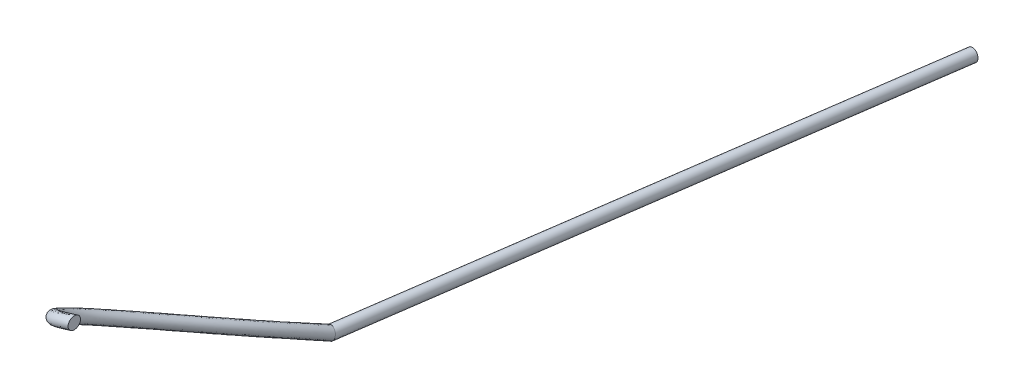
ISO-10303-21;
HEADER;
FILE_DESCRIPTION(('STEP AP214'),'2;1');
FILE_NAME('part.step','',(''),(''),'','','');
FILE_SCHEMA(('AUTOMOTIVE_DESIGN { 1 0 10303 214 1 1 1 1 }'));
ENDSEC;
DATA;
#1=APPLICATION_CONTEXT('core data for automotive mechanical design processes');
#2=APPLICATION_PROTOCOL_DEFINITION('international standard','automotive_design',2000,#1);
#3=PRODUCT_CONTEXT('',#1,'mechanical');
#4=PRODUCT('Part','Part','',(#3));
#5=PRODUCT_RELATED_PRODUCT_CATEGORY('part','',(#4));
#6=PRODUCT_DEFINITION_FORMATION('','',#4);
#7=PRODUCT_DEFINITION_CONTEXT('part definition',#1,'design');
#8=PRODUCT_DEFINITION('design','',#6,#7);
#9=PRODUCT_DEFINITION_SHAPE('','',#8);
#10=(LENGTH_UNIT() NAMED_UNIT(*) SI_UNIT(.MILLI.,.METRE.));
#11=(NAMED_UNIT(*) PLANE_ANGLE_UNIT() SI_UNIT($,.RADIAN.));
#12=(NAMED_UNIT(*) SI_UNIT($,.STERADIAN.) SOLID_ANGLE_UNIT());
#13=UNCERTAINTY_MEASURE_WITH_UNIT(LENGTH_MEASURE(1.E-05),#10,'distance_accuracy_value','');
#14=(GEOMETRIC_REPRESENTATION_CONTEXT(3) GLOBAL_UNCERTAINTY_ASSIGNED_CONTEXT((#13)) GLOBAL_UNIT_ASSIGNED_CONTEXT((#10,
#11,#12)) REPRESENTATION_CONTEXT('',''));
#15=CARTESIAN_POINT('',(0.,0.,0.));
#16=DIRECTION('',(0.,0.,1.));
#17=DIRECTION('',(1.,0.,0.));
#18=AXIS2_PLACEMENT_3D('',#15,#16,#17);
#19=CARTESIAN_POINT('',(-17.0427389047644,-267.676806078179,106.580411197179));
#20=CARTESIAN_POINT('',(-17.7285508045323,-267.849592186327,106.643436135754));
#21=CARTESIAN_POINT('',(-19.0533972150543,-268.18337912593,106.765187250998));
#22=CARTESIAN_POINT('',(-21.1201998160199,-268.789453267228,106.784475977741));
#23=CARTESIAN_POINT('',(-23.025936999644,-269.516233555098,106.4665127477));
#24=CARTESIAN_POINT('',(-24.6776012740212,-270.342091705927,105.799146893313));
#25=CARTESIAN_POINT('',(-26.0114073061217,-271.245941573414,104.786544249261));
#26=CARTESIAN_POINT('',(-26.979310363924,-272.179148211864,103.49732285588));
#27=CARTESIAN_POINT('',(-27.5980570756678,-273.102416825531,102.020016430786));
#28=CARTESIAN_POINT('',(-27.9234426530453,-274.004580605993,100.410180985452));
#29=CARTESIAN_POINT('',(-28.0102352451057,-274.892498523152,98.686724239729));
#30=CARTESIAN_POINT('',(-27.7342864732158,-276.927503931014,94.4539287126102));
#31=CARTESIAN_POINT('',(-25.6707994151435,-279.811967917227,87.4583805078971));
#32=CARTESIAN_POINT('',(-21.6918461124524,-283.442468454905,77.8296465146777));
#33=CARTESIAN_POINT('',(-17.0369705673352,-287.027333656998,67.8924653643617));
#34=CARTESIAN_POINT('',(-12.0725304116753,-290.908444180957,57.1699750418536));
#35=CARTESIAN_POINT('',(-7.921328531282,-295.151095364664,46.1972954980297));
#36=CARTESIAN_POINT('',(-5.6273239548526,-298.393398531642,38.4021256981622));
#37=CARTESIAN_POINT('',(-4.57502816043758,-299.880693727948,34.8263593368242));
#38=CARTESIAN_POINT('',(-17.0078380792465,-263.676958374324,106.580938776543));
#39=CARTESIAN_POINT('',(-17.7024242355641,-263.849380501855,106.649917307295));
#40=CARTESIAN_POINT('',(-19.0442206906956,-264.182464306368,106.783169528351));
#41=CARTESIAN_POINT('',(-21.3573952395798,-264.794373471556,106.937529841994));
#42=CARTESIAN_POINT('',(-23.6304688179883,-265.564635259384,106.751416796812));
#43=CARTESIAN_POINT('',(-25.7356227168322,-266.49036843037,106.154469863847));
#44=CARTESIAN_POINT('',(-27.5518285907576,-267.556753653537,105.104231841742));
#45=CARTESIAN_POINT('',(-28.9369933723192,-268.68585937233,103.671877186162));
#46=CARTESIAN_POINT('',(-29.8600439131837,-269.79692175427,102.000364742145));
#47=CARTESIAN_POINT('',(-30.38719220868,-270.856548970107,100.195886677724));
#48=CARTESIAN_POINT('',(-30.603969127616,-271.86934892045,98.3001755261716));
#49=CARTESIAN_POINT('',(-30.5165688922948,-274.126265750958,93.7359912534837));
#50=CARTESIAN_POINT('',(-28.4828849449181,-277.130658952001,86.5187785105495));
#51=CARTESIAN_POINT('',(-24.531103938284,-280.833452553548,76.7594514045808));
#52=CARTESIAN_POINT('',(-19.8794876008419,-284.44036464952,66.7874930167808));
#53=CARTESIAN_POINT('',(-14.8984500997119,-288.279185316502,56.1116912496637));
#54=CARTESIAN_POINT('',(-10.7362991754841,-292.417360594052,45.4170236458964));
#55=CARTESIAN_POINT('',(-8.38836587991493,-295.67215593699,37.3986216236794));
#56=CARTESIAN_POINT('',(-7.31133213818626,-297.16518148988,33.720455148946));
#57=CARTESIAN_POINT('',(-16.9473788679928,-263.676958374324,102.58139571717));
#58=CARTESIAN_POINT('',(-17.6237721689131,-263.844280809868,102.64973413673));
#59=CARTESIAN_POINT('',(-18.9304237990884,-264.16751306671,102.781749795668));
#60=CARTESIAN_POINT('',(-20.7693724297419,-264.621906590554,102.968575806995));
#61=CARTESIAN_POINT('',(-22.4146943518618,-265.126288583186,102.940140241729));
#62=CARTESIAN_POINT('',(-23.8502061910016,-265.682571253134,102.682981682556));
#63=CARTESIAN_POINT('',(-25.0824443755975,-266.305733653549,102.171047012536));
#64=CARTESIAN_POINT('',(-26.0886178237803,-267.002121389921,101.378076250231));
#65=CARTESIAN_POINT('',(-26.8377199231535,-267.757527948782,100.314004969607));
#66=CARTESIAN_POINT('',(-27.3246696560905,-268.551948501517,99.0158013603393));
#67=CARTESIAN_POINT('',(-27.5689922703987,-269.372981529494,97.5198903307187));
#68=CARTESIAN_POINT('',(-27.6144831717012,-271.315359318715,93.6637308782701));
#69=CARTESIAN_POINT('',(-25.7955596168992,-274.19437201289,86.8249096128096));
#70=CARTESIAN_POINT('',(-21.953329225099,-277.815529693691,77.2957523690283));
#71=CARTESIAN_POINT('',(-17.3511590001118,-281.401491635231,67.3912863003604));
#72=CARTESIAN_POINT('',(-12.2849548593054,-285.285639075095,56.5880529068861));
#73=CARTESIAN_POINT('',(-7.98835948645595,-289.514969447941,45.6693276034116));
#74=CARTESIAN_POINT('',(-5.58629998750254,-292.816096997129,37.4215273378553));
#75=CARTESIAN_POINT('',(-4.48443770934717,-294.330375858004,33.638132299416));
#76=CARTESIAN_POINT('',(-16.9822796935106,-267.676806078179,102.580868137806));
#77=CARTESIAN_POINT('',(-17.6498987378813,-267.84449249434,102.643252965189));
#78=CARTESIAN_POINT('',(-18.9396003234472,-268.168427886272,102.763767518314));
#79=CARTESIAN_POINT('',(-20.532177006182,-268.616986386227,102.815521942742));
#80=CARTESIAN_POINT('',(-21.8101625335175,-269.077886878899,102.655236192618));
#81=CARTESIAN_POINT('',(-22.7921847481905,-269.53429452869,102.327658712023));
#82=CARTESIAN_POINT('',(-23.5420230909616,-269.994921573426,101.853359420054));
#83=CARTESIAN_POINT('',(-24.1309348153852,-270.495410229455,101.20352191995));
#84=CARTESIAN_POINT('',(-24.5757330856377,-271.063023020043,100.333656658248));
#85=CARTESIAN_POINT('',(-24.8609201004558,-271.699980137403,99.2300956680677));
#86=CARTESIAN_POINT('',(-24.9752583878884,-272.396131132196,97.9064390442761));
#87=CARTESIAN_POINT('',(-24.8322007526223,-274.116597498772,94.3816683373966));
#88=CARTESIAN_POINT('',(-22.9834740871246,-276.875680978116,87.7645116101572));
#89=CARTESIAN_POINT('',(-19.1140713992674,-280.424545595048,78.3659474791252));
#90=CARTESIAN_POINT('',(-14.5086419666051,-283.988460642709,68.4962586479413));
#91=CARTESIAN_POINT('',(-9.45903517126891,-287.914897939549,57.646336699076));
#92=CARTESIAN_POINT('',(-5.17338884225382,-292.248704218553,46.449599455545));
#93=CARTESIAN_POINT('',(-2.82525806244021,-295.53733959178,38.425031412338));
#94=CARTESIAN_POINT('',(-1.74813373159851,-297.045888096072,34.7440364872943));
#95=CARTESIAN_POINT('',(-17.0171805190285,-271.676653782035,102.580340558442));
#96=CARTESIAN_POINT('',(-17.6760253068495,-271.844704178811,102.636771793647));
#97=CARTESIAN_POINT('',(-18.9487768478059,-272.169342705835,102.74578524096));
#98=CARTESIAN_POINT('',(-20.2949815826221,-272.612066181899,102.662468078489));
#99=CARTESIAN_POINT('',(-21.2056307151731,-273.029485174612,102.370332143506));
#100=CARTESIAN_POINT('',(-21.7341633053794,-273.386017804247,101.972335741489));
#101=CARTESIAN_POINT('',(-22.0016018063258,-273.684109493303,101.535671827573));
#102=CARTESIAN_POINT('',(-22.17325180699,-273.988699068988,101.028967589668));
#103=CARTESIAN_POINT('',(-22.3137462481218,-274.368518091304,100.353308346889));
#104=CARTESIAN_POINT('',(-22.3971705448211,-274.848011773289,99.4443899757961));
#105=CARTESIAN_POINT('',(-22.3815245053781,-275.419280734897,98.2929877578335));
#106=CARTESIAN_POINT('',(-22.0499183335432,-276.917835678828,95.0996057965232));
#107=CARTESIAN_POINT('',(-20.1713885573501,-279.556989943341,88.7041136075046));
#108=CARTESIAN_POINT('',(-16.2748135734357,-283.033561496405,79.4361425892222));
#109=CARTESIAN_POINT('',(-11.6661249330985,-286.575429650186,69.6012309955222));
#110=CARTESIAN_POINT('',(-6.63311548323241,-290.544156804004,58.7046204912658));
#111=CARTESIAN_POINT('',(-2.35841819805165,-294.982438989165,47.2298713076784));
#112=CARTESIAN_POINT('',(-0.0642161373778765,-298.258582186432,39.4285354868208));
#113=CARTESIAN_POINT('',(0.988170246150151,-299.761400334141,35.8499406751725));
#114=CARTESIAN_POINT('',(-17.0776397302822,-271.676653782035,106.579883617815));
#115=CARTESIAN_POINT('',(-17.7546773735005,-271.849803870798,106.636954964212));
#116=CARTESIAN_POINT('',(-19.0625737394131,-272.184293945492,106.747204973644));
#117=CARTESIAN_POINT('',(-20.88300439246,-272.784533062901,106.631422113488));
#118=CARTESIAN_POINT('',(-22.4214051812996,-273.467831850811,106.181608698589));
#119=CARTESIAN_POINT('',(-23.6195798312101,-274.193814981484,105.44382392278));
#120=CARTESIAN_POINT('',(-24.4709860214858,-274.935129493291,104.468856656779));
#121=CARTESIAN_POINT('',(-25.0216273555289,-275.672437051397,103.322768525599));
#122=CARTESIAN_POINT('',(-25.3360702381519,-276.407911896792,102.039668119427));
#123=CARTESIAN_POINT('',(-25.4596930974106,-277.15261224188,100.624475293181));
#124=CARTESIAN_POINT('',(-25.4165013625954,-277.915648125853,99.0732729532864));
#125=CARTESIAN_POINT('',(-24.9520040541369,-279.728742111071,95.1718661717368));
#126=CARTESIAN_POINT('',(-22.8587138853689,-282.493276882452,88.3979825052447));
#127=CARTESIAN_POINT('',(-18.8525882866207,-286.051484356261,78.8998416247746));
#128=CARTESIAN_POINT('',(-14.1944535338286,-289.614302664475,68.9974377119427));
#129=CARTESIAN_POINT('',(-9.24661072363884,-293.537703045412,58.2282588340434));
#130=CARTESIAN_POINT('',(-5.10635788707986,-297.884830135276,46.9775673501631));
#131=CARTESIAN_POINT('',(-2.86628202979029,-301.114641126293,39.4056297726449));
#132=CARTESIAN_POINT('',(-1.83872418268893,-302.596205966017,35.9322635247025));
#133=CARTESIAN_POINT('',(-17.0427389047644,-267.676806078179,106.580411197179));
#134=CARTESIAN_POINT('',(-17.7285508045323,-267.849592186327,106.643436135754));
#135=CARTESIAN_POINT('',(-19.0533972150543,-268.18337912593,106.765187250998));
#136=CARTESIAN_POINT('',(-21.1201998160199,-268.789453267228,106.784475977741));
#137=CARTESIAN_POINT('',(-23.025936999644,-269.516233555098,106.4665127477));
#138=CARTESIAN_POINT('',(-24.6776012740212,-270.342091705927,105.799146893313));
#139=CARTESIAN_POINT('',(-26.0114073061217,-271.245941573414,104.786544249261));
#140=CARTESIAN_POINT('',(-26.979310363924,-272.179148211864,103.49732285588));
#141=CARTESIAN_POINT('',(-27.5980570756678,-273.102416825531,102.020016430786));
#142=CARTESIAN_POINT('',(-27.9234426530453,-274.004580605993,100.410180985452));
#143=CARTESIAN_POINT('',(-28.0102352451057,-274.892498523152,98.686724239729));
#144=CARTESIAN_POINT('',(-27.7342864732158,-276.927503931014,94.4539287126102));
#145=CARTESIAN_POINT('',(-25.6707994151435,-279.811967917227,87.4583805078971));
#146=CARTESIAN_POINT('',(-21.6918461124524,-283.442468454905,77.8296465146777));
#147=CARTESIAN_POINT('',(-17.0369705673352,-287.027333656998,67.8924653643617));
#148=CARTESIAN_POINT('',(-12.0725304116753,-290.908444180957,57.1699750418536));
#149=CARTESIAN_POINT('',(-7.921328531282,-295.151095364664,46.1972954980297));
#150=CARTESIAN_POINT('',(-5.6273239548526,-298.393398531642,38.4021256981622));
#151=CARTESIAN_POINT('',(-4.57502816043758,-299.880693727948,34.8263593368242));
#152=(BOUNDED_SURFACE() B_SPLINE_SURFACE(3,3,((#19,#20,#21,#22,#23,#24,#25,#26,#27,#28,#29,#30,
#31,#32,#33,#34,#35,#36,#37),(#38,#39,#40,#41,#42,#43,#44,#45,#46,#47,#48,#49,#50,#51,#52,#53,
#54,#55,#56),(#57,#58,#59,#60,#61,#62,#63,#64,#65,#66,#67,#68,#69,#70,#71,#72,#73,#74,#75),(#76,
#77,#78,#79,#80,#81,#82,#83,#84,#85,#86,#87,#88,#89,#90,#91,#92,#93,#94),(#95,#96,#97,#98,#99,
#100,#101,#102,#103,#104,#105,#106,#107,#108,#109,#110,#111,#112,#113),(#114,#115,#116,#117,
#118,#119,#120,#121,#122,#123,#124,#125,#126,#127,#128,#129,#130,#131,#132),(#133,#134,#135,
#136,#137,#138,#139,#140,#141,#142,#143,#144,#145,#146,#147,#148,#149,#150,#151)),.UNSPECIFIED.,
.T.,.F.,.F.) B_SPLINE_SURFACE_WITH_KNOTS((4,3,4),(4,1,1,1,1,1,1,1,1,1,1,1,1,1,1,1,4),(0.,0.5,
1.),(0.,0.0240266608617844,0.0464145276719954,0.0662905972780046,0.0843006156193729,
0.101317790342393,0.118159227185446,0.135532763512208,0.153990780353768,0.173894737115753,
0.195433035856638,0.303440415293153,0.433033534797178,0.569668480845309,0.697123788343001,
0.861065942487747,1.),
.UNSPECIFIED.) GEOMETRIC_REPRESENTATION_ITEM() RATIONAL_B_SPLINE_SURFACE(((1.,1.,1.,1.,1.,1.,1.,
0.999999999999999,1.,1.,1.,1.,1.,1.,1.,1.,1.,1.,1.),(0.333333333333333,0.333333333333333,
0.333333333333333,0.333333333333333,0.333333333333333,0.333333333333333,0.333333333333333,
0.333333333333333,0.333333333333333,0.333333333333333,0.333333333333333,0.333333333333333,
0.333333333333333,0.333333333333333,0.333333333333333,0.333333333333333,0.333333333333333,
0.333333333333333,0.333333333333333),(0.333333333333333,0.333333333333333,0.333333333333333,
0.333333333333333,0.333333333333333,0.333333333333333,0.333333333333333,0.333333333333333,
0.333333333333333,0.333333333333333,0.333333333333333,0.333333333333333,0.333333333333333,
0.333333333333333,0.333333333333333,0.333333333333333,0.333333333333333,0.333333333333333,
0.333333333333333),(1.,1.,1.,1.,1.,1.,1.,0.999999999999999,1.,1.,1.,1.,1.,1.,1.,1.,1.,1.,1.),
(0.333333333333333,0.333333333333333,0.333333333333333,0.333333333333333,0.333333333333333,
0.333333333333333,0.333333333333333,0.333333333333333,0.333333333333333,0.333333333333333,
0.333333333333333,0.333333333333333,0.333333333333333,0.333333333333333,0.333333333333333,
0.333333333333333,0.333333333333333,0.333333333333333,0.333333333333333),(0.333333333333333,
0.333333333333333,0.333333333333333,0.333333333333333,0.333333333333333,0.333333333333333,
0.333333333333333,0.333333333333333,0.333333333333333,0.333333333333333,0.333333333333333,
0.333333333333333,0.333333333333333,0.333333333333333,0.333333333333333,0.333333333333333,
0.333333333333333,0.333333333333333,0.333333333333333),(1.,1.,1.,1.,1.,1.,1.,0.999999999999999,
1.,1.,1.,1.,1.,1.,1.,1.,1.,1.,1.))) REPRESENTATION_ITEM('') SURFACE());
#153=CARTESIAN_POINT('',(-17.0125092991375,-267.676806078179,104.580639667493));
#154=DIRECTION('',(-0.999847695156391,0.00872620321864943,-0.0151142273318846));
#155=DIRECTION('',(-0.0151148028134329,0.,0.99988576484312));
#156=AXIS2_PLACEMENT_3D('',#153,#154,#155);
#157=CIRCLE('',#156,2.00000000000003);
#158=CARTESIAN_POINT('',(-17.0427389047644,-267.676806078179,106.580411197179));
#159=VERTEX_POINT('',#158);
#160=EDGE_CURVE('E10',#159,#159,#157,.T.);
#161=CARTESIAN_POINT('',(-4.57502816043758,-299.880693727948,34.8263593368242));
#162=CARTESIAN_POINT('',(-1.83872418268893,-302.596205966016,35.9322635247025));
#163=CARTESIAN_POINT('',(0.988170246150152,-299.76140033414,35.8499406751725));
#164=CARTESIAN_POINT('',(-1.7481337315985,-297.045888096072,34.7440364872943));
#165=CARTESIAN_POINT('',(-4.48443770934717,-294.330375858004,33.638132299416));
#166=CARTESIAN_POINT('',(-7.31133213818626,-297.16518148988,33.720455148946));
#167=CARTESIAN_POINT('',(-4.57502816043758,-299.880693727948,34.8263593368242));
#168=(BOUNDED_CURVE() B_SPLINE_CURVE(3,(#161,#162,#163,#164,#165,#166,#167),.UNSPECIFIED.,.T.,
.F.) B_SPLINE_CURVE_WITH_KNOTS((4,3,4),(0.,0.5,1.),
.UNSPECIFIED.) CURVE() GEOMETRIC_REPRESENTATION_ITEM() RATIONAL_B_SPLINE_CURVE((1.,
0.333333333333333,0.333333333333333,1.,0.333333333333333,0.333333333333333,1.)) REPRESENTATION_ITEM(''));
#169=CARTESIAN_POINT('',(-4.57502816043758,-299.880693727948,34.8263593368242));
#170=VERTEX_POINT('',#169);
#171=EDGE_CURVE('E40',#170,#170,#168,.T.);
#172=ORIENTED_EDGE('',*,*,#160,.T.);
#173=EDGE_LOOP('',(#172));
#174=FACE_BOUND('',#173,.T.);
#175=ORIENTED_EDGE('',*,*,#171,.T.);
#176=EDGE_LOOP('',(#175));
#177=FACE_BOUND('',#176,.T.);
#178=ADVANCED_FACE('F28',(#174,#177),#152,.T.);
#179=CARTESIAN_POINT('',(-17.0125092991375,-267.676806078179,104.580639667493));
#180=DIRECTION('',(-0.999847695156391,0.00872620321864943,-0.0151142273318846));
#181=DIRECTION('',(-0.0151148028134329,0.,0.99988576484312));
#182=AXIS2_PLACEMENT_3D('',#179,#180,#181);
#183=PLANE('',#182);
#184=ORIENTED_EDGE('',*,*,#160,.F.);
#185=EDGE_LOOP('',(#184));
#186=FACE_BOUND('',#185,.T.);
#187=ADVANCED_FACE('F66',(#186),#183,.F.);
#188=CARTESIAN_POINT('',(16.6166397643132,-304.935508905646,-156.638878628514));
#189=DIRECTION('',(0.0954391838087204,-0.0410012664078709,-0.994590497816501));
#190=DIRECTION('',(-0.995427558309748,0.,-0.0955195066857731));
#191=AXIS2_PLACEMENT_3D('',#188,#189,#190);
#192=PLANE('',#191);
#193=CARTESIAN_POINT('',(13.8122158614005,-307.779968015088,-156.790725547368));
#194=CARTESIAN_POINT('',(16.6179453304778,-310.52530587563,-156.408318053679));
#195=CARTESIAN_POINT('',(19.4223692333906,-307.680846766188,-156.256471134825));
#196=CARTESIAN_POINT('',(16.6166397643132,-304.935508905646,-156.638878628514));
#197=CARTESIAN_POINT('',(13.8109102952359,-302.190171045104,-157.021286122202));
#198=CARTESIAN_POINT('',(11.0064863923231,-305.034630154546,-157.173133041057));
#199=CARTESIAN_POINT('',(13.8122158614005,-307.779968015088,-156.790725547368));
#200=(BOUNDED_CURVE() B_SPLINE_CURVE(3,(#193,#194,#195,#196,#197,#198,#199),.UNSPECIFIED.,.T.,
.F.) B_SPLINE_CURVE_WITH_KNOTS((4,3,4),(0.,0.5,1.),
.UNSPECIFIED.) CURVE() GEOMETRIC_REPRESENTATION_ITEM() RATIONAL_B_SPLINE_CURVE((1.,
0.333333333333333,0.333333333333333,1.,0.333333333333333,0.333333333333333,1.)) REPRESENTATION_ITEM(''));
#201=CARTESIAN_POINT('',(13.8122158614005,-307.779968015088,-156.790725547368));
#202=VERTEX_POINT('',#201);
#203=EDGE_CURVE('E36',#202,#202,#200,.F.);
#204=ORIENTED_EDGE('',*,*,#203,.T.);
#205=EDGE_LOOP('',(#204));
#206=FACE_BOUND('',#205,.T.);
#207=ADVANCED_FACE('F61',(#206),#192,.T.);
#208=CARTESIAN_POINT('',(-4.57502816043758,-299.880693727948,34.8263593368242));
#209=CARTESIAN_POINT('',(13.8122158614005,-307.779968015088,-156.790725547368));
#210=CARTESIAN_POINT('',(-1.83872418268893,-302.596205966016,35.9322635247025));
#211=CARTESIAN_POINT('',(16.6179453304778,-310.52530587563,-156.408318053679));
#212=CARTESIAN_POINT('',(0.988170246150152,-299.76140033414,35.8499406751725));
#213=CARTESIAN_POINT('',(19.4223692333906,-307.680846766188,-156.256471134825));
#214=CARTESIAN_POINT('',(-1.7481337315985,-297.045888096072,34.7440364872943));
#215=CARTESIAN_POINT('',(16.6166397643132,-304.935508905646,-156.638878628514));
#216=CARTESIAN_POINT('',(-4.48443770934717,-294.330375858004,33.638132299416));
#217=CARTESIAN_POINT('',(13.8109102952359,-302.190171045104,-157.021286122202));
#218=CARTESIAN_POINT('',(-7.31133213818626,-297.16518148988,33.720455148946));
#219=CARTESIAN_POINT('',(11.0064863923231,-305.034630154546,-157.173133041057));
#220=CARTESIAN_POINT('',(-4.57502816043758,-299.880693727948,34.8263593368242));
#221=CARTESIAN_POINT('',(13.8122158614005,-307.779968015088,-156.790725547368));
#222=(BOUNDED_SURFACE() B_SPLINE_SURFACE(3,1,((#208,#209),(#210,#211),(#212,#213),(#214,#215),
(#216,#217),(#218,#219),(#220,#221)),.UNSPECIFIED.,.T.,.F.,.F.) B_SPLINE_SURFACE_WITH_KNOTS((4,
3,4),(2,2),(0.,0.5,1.),(0.,1.),
.UNSPECIFIED.) GEOMETRIC_REPRESENTATION_ITEM() RATIONAL_B_SPLINE_SURFACE(((1.,1.),
(0.333333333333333,0.333333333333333),(0.333333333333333,0.333333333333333),(1.,1.),
(0.333333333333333,0.333333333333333),(0.333333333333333,0.333333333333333),(1.,1.))) REPRESENTATION_ITEM('') SURFACE());
#223=ORIENTED_EDGE('',*,*,#171,.F.);
#224=EDGE_LOOP('',(#223));
#225=FACE_BOUND('',#224,.T.);
#226=ORIENTED_EDGE('',*,*,#203,.F.);
#227=EDGE_LOOP('',(#226));
#228=FACE_BOUND('',#227,.T.);
#229=ADVANCED_FACE('F58',(#225,#228),#222,.F.);
#230=CLOSED_SHELL('',(#178,#187,#207,#229));
#231=MANIFOLD_SOLID_BREP('B2',#230);
#232=ADVANCED_BREP_SHAPE_REPRESENTATION('',(#18,#231),#14);
#233=SHAPE_DEFINITION_REPRESENTATION(#9,#232);
ENDSEC;
END-ISO-10303-21;
